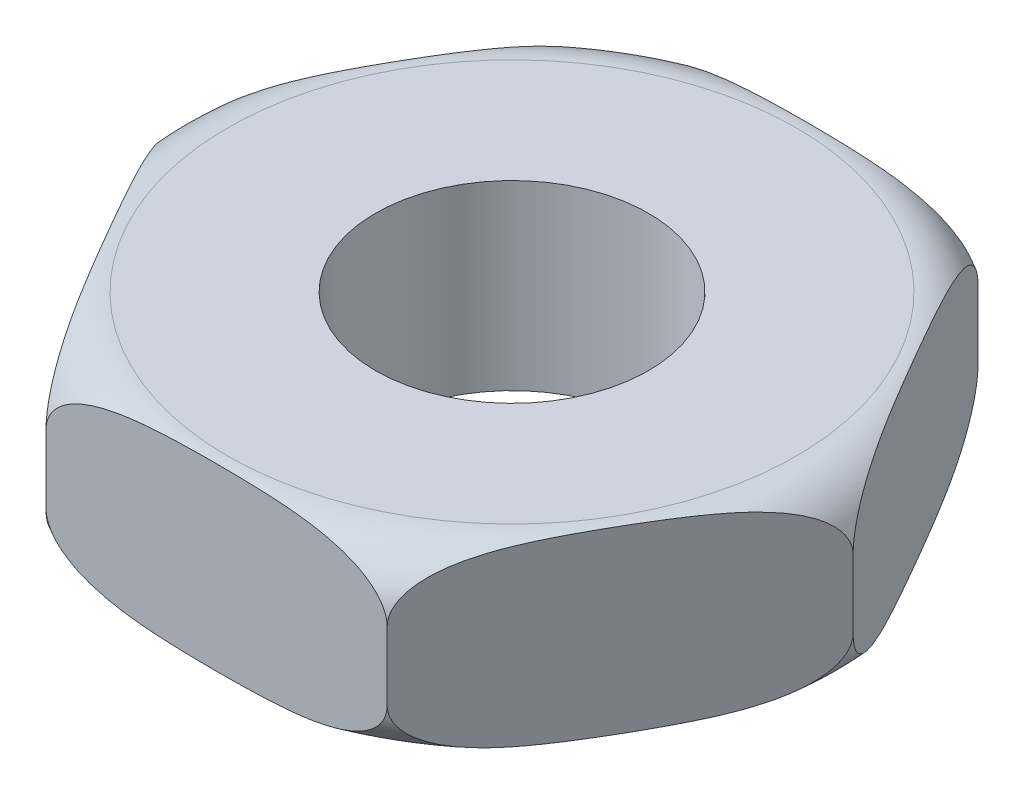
from build123d import *

# Parameters (mm, degrees)
SKETCH1_R      = 6
EXTRUDE1_DEPTH = 4


with BuildPart() as part:
    # Sketch1 → Extrude1 (new, symmetric)
    with BuildSketch(Plane(origin=(0, 0, 0), x_dir=(1, 0, 0), z_dir=(0, 1, 0))):
        Polygon((15, 0), (7.5, 12.990381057), (-7.5, 12.990381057), (-15, 0), (-7.5, -12.990381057), (7.5, -12.990381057), align=None)
        with Locations(Location((0, 0, 0), (0, 0, 270))):
            Circle(SKETCH1_R, mode=Mode.SUBTRACT)
    extrude(amount=EXTRUDE1_DEPTH, both=True)

    # Sketch2 → Cut-Revolve1 (revolve, cut)
    with BuildSketch(Plane.XY, mode=Mode.PRIVATE) as cut_revolve1_sk:
        with BuildLine():
            Line((12.5, 4), (12.5, 5.957161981))
            Line((12.5, 5.957161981), (12.870515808, 5.957161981))
            Line((12.870515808, 5.957161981), (16.39892905, 5.957161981))
            Line((16.39892905, 5.957161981), (16.39892905, 1.5))
            Line((16.39892905, 1.5), (15, 1.5))
            ThreePointArc((15, 1.5), (14.267766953, 3.267766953), (12.5, 4))
        make_face()
        with BuildLine():
            Line((16.39892905, -1.5), (15, -1.5))
            ThreePointArc((15, -1.5), (14.267766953, -3.267766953), (12.5, -4))
            Line((12.5, -4), (12.5, -5.957161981))
            Line((12.5, -5.957161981), (12.870515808, -5.957161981))
            Line((12.870515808, -5.957161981), (16.39892905, -5.957161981))
            Line((16.39892905, -5.957161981), (16.39892905, -1.5))
        make_face()
    revolve(cut_revolve1_sk.sketch.rotate(Axis((0, 5.198572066, 0), (0, -1, 0)), 90), axis=Axis((0, 5.198572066, 0), (0, -1, 0)), mode=Mode.SUBTRACT)


solid = part.part
